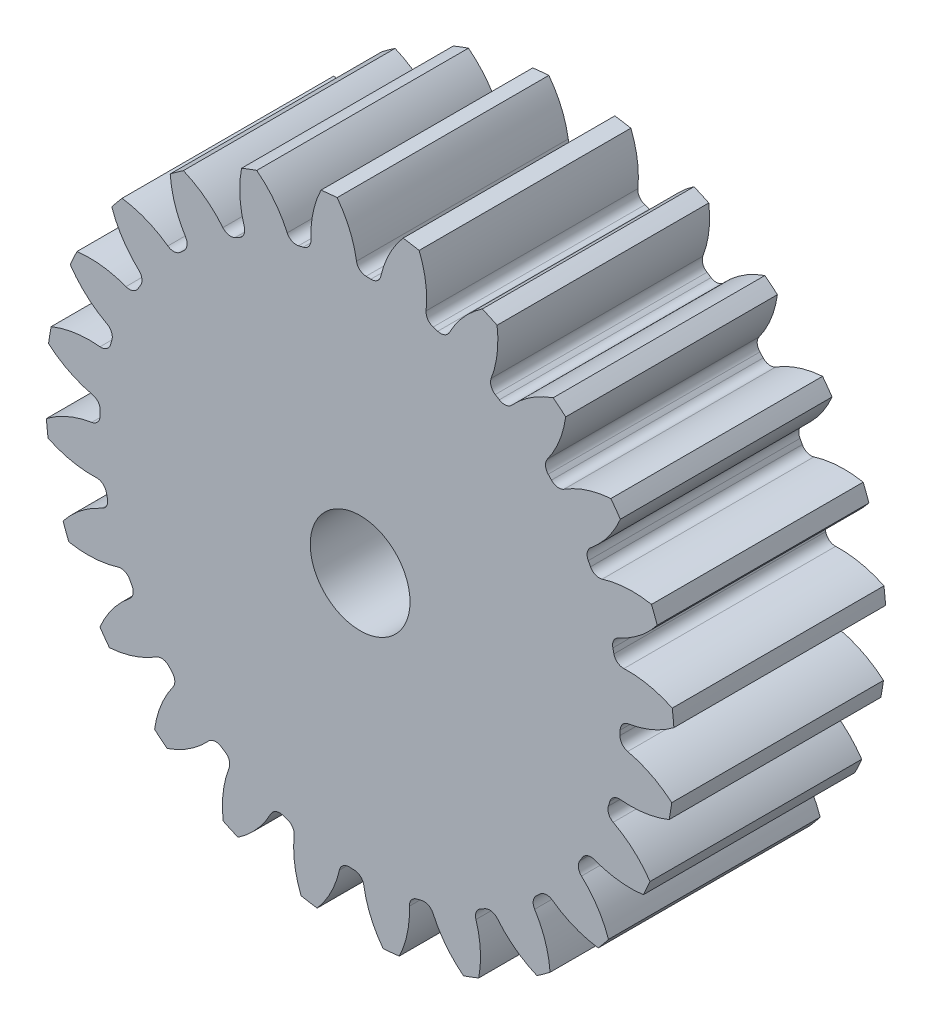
from build123d import *

# Parameters (mm, degrees)
SKETCH3_R         = 132.08
GEARBODY_DEPTH    = 88.9
TOOTHCUT_DEPTH    = 207.865808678
CIRPATTERN1_COUNT = 24
BOREDIA_R         = 20.955
BORE_DEPTH        = 12700


with BuildPart() as part:
    # Sketch3 → gearBody (new body)
    with BuildSketch(Plane.XY):
        Circle(SKETCH3_R)
    extrude(amount=GEARBODY_DEPTH)

    # Sketch2 → toothCut (cut, through all)
    with BuildSketch(Plane.XY):
        with BuildLine():
            ThreePointArc((109.127452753, -4.495270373), (109.164300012, -3.487693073), (109.191844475, -2.479818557))
            ThreePointArc((109.191844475, -2.479818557), (110.208570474, 0.143182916), (112.66805981, 1.508752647))
            ThreePointArc((112.66805981, 1.508752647), (122.901170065, 4.500166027), (132.08, 9.923650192))
            ThreePointArc((132.08, 9.923650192), (132.384727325, -4.229563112), (131.177180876, -18.334460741))
            ThreePointArc((131.177180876, -18.334460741), (122.363266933, -12.336125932), (112.341976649, -8.69760418))
            ThreePointArc((112.341976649, -8.69760418), (109.974671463, -7.177823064), (109.127452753, -4.495270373))
        make_face()
    toothcut = extrude(amount=TOOTHCUT_DEPTH, mode=Mode.SUBTRACT)

    # CirPattern1: toothCut ×24 about axis
    cirpattern1_axis = Axis((0, 0, 0), (0, 0, 1))
    for i in range(1, CIRPATTERN1_COUNT):
        add(toothcut.rotate(cirpattern1_axis, i * 360 / CIRPATTERN1_COUNT), mode=Mode.SUBTRACT)

    # boreDia → bore (cut, symmetric)
    with BuildSketch(Plane.XY):
        Circle(BOREDIA_R)
    extrude(amount=BORE_DEPTH, both=True, mode=Mode.SUBTRACT)


solid = part.part
